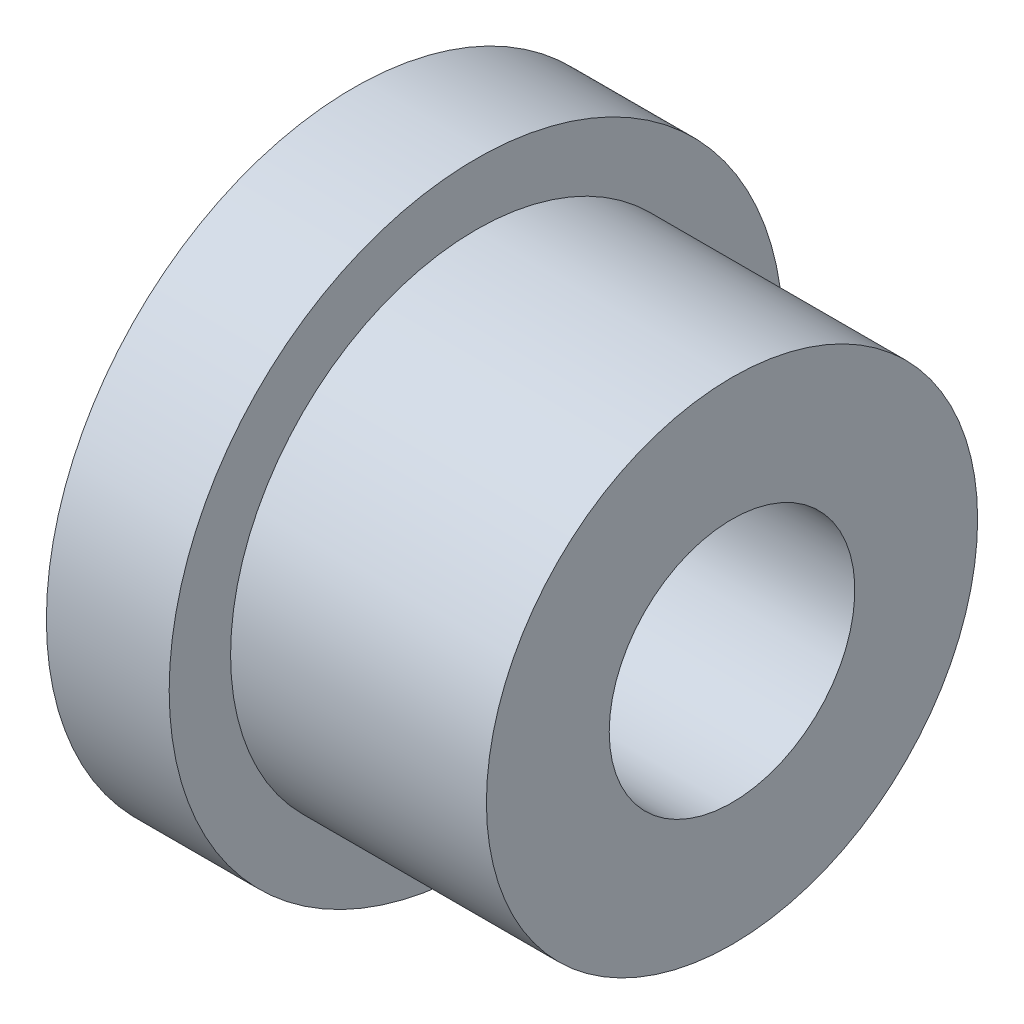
from build123d import *


with BuildPart() as part:
    # Esquisse1 → Base-R_volution (revolve)
    with BuildSketch(Plane.XY, mode=Mode.PRIVATE) as base_r_volution_sk:
        Polygon((0, 3), (0, 7.5), (3, 7.5), (3, 6), (9.25, 6), (9.25, 3), align=None)
    revolve(base_r_volution_sk.sketch.rotate(Axis((-9.586087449, 0, 0), (1, 0, 0)), 90), axis=Axis((-9.586087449, 0, 0), (1, 0, 0)))


solid = part.part
